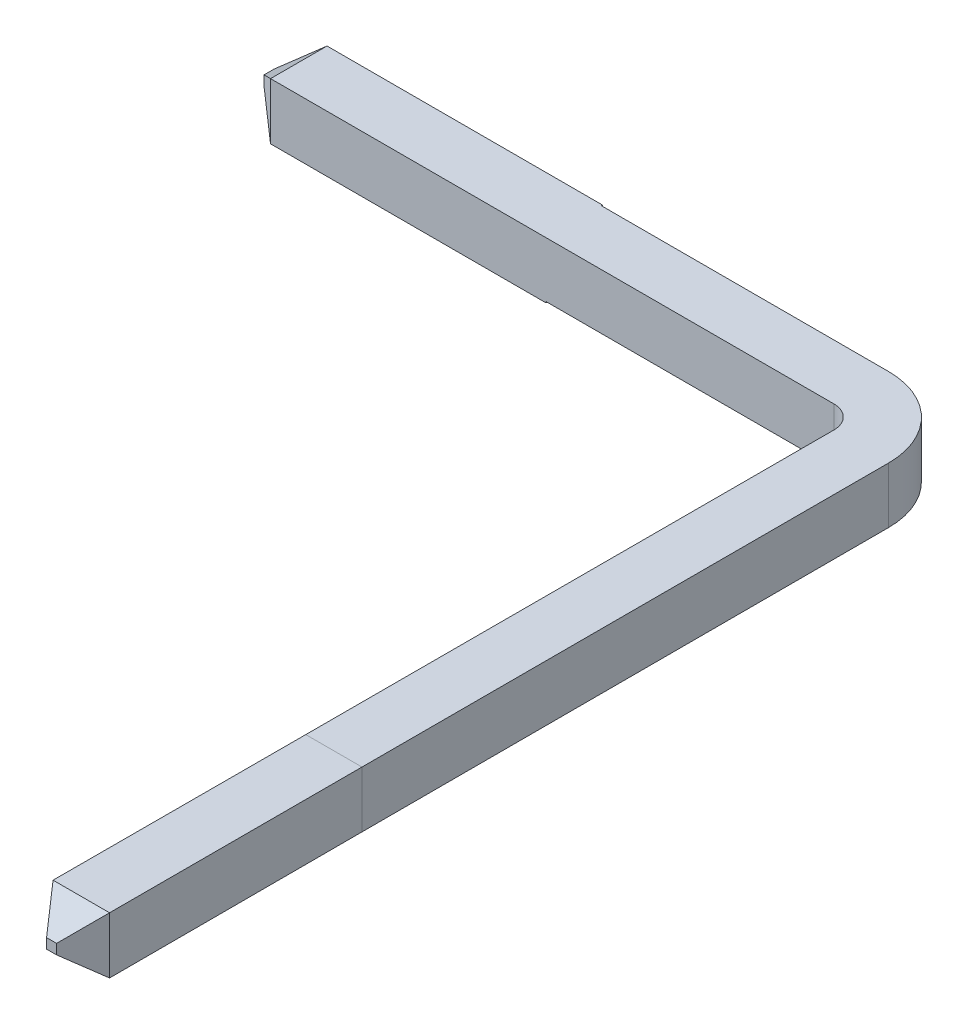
ISO-10303-21;
HEADER;
FILE_DESCRIPTION(('STEP AP214'),'2;1');
FILE_NAME('part.step','',(''),(''),'','','');
FILE_SCHEMA(('AUTOMOTIVE_DESIGN { 1 0 10303 214 1 1 1 1 }'));
ENDSEC;
DATA;
#1=APPLICATION_CONTEXT('core data for automotive mechanical design processes');
#2=APPLICATION_PROTOCOL_DEFINITION('international standard','automotive_design',2000,#1);
#3=PRODUCT_CONTEXT('',#1,'mechanical');
#4=PRODUCT('Part','Part','',(#3));
#5=PRODUCT_RELATED_PRODUCT_CATEGORY('part','',(#4));
#6=PRODUCT_DEFINITION_FORMATION('','',#4);
#7=PRODUCT_DEFINITION_CONTEXT('part definition',#1,'design');
#8=PRODUCT_DEFINITION('design','',#6,#7);
#9=PRODUCT_DEFINITION_SHAPE('','',#8);
#10=(LENGTH_UNIT() NAMED_UNIT(*) SI_UNIT(.MILLI.,.METRE.));
#11=(NAMED_UNIT(*) PLANE_ANGLE_UNIT() SI_UNIT($,.RADIAN.));
#12=(NAMED_UNIT(*) SI_UNIT($,.STERADIAN.) SOLID_ANGLE_UNIT());
#13=UNCERTAINTY_MEASURE_WITH_UNIT(LENGTH_MEASURE(1.E-05),#10,'distance_accuracy_value','');
#14=(GEOMETRIC_REPRESENTATION_CONTEXT(3) GLOBAL_UNCERTAINTY_ASSIGNED_CONTEXT((#13)) GLOBAL_UNIT_ASSIGNED_CONTEXT((#10,
#11,#12)) REPRESENTATION_CONTEXT('',''));
#15=CARTESIAN_POINT('',(0.,0.,0.));
#16=DIRECTION('',(0.,0.,1.));
#17=DIRECTION('',(1.,0.,0.));
#18=AXIS2_PLACEMENT_3D('',#15,#16,#17);
#19=CARTESIAN_POINT('',(-2.543175,-12.3888499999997,-0.916440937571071));
#20=DIRECTION('',(0.,1.,0.));
#21=DIRECTION('',(0.,0.,-1.));
#22=AXIS2_PLACEMENT_3D('',#19,#20,#21);
#23=PLANE('',#22);
#24=DIRECTION('',(0.,0.,1.));
#25=VECTOR('',#24,1.);
#26=CARTESIAN_POINT('',(-2.22885,-12.3888499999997,-0.916440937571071));
#27=LINE('',#26,#25);
#28=CARTESIAN_POINT('',(-2.22885,-12.3888499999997,-0.0274409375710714));
#29=VERTEX_POINT('',#28);
#30=CARTESIAN_POINT('',(-2.225675,-12.3856749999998,5.89710906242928));
#31=VERTEX_POINT('',#30);
#32=EDGE_CURVE('E297',#29,#31,#27,.T.);
#33=ORIENTED_EDGE('',*,*,#32,.F.);
#34=CARTESIAN_POINT('',(-3.11785,-12.3888499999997,-0.0274409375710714));
#35=DIRECTION('',(0.,1.,0.));
#36=DIRECTION('',(0.,0.,-1.));
#37=AXIS2_PLACEMENT_3D('',#34,#35,#36);
#38=CIRCLE('',#37,0.889);
#39=CARTESIAN_POINT('',(-3.11785,-12.3888499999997,-0.916440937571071));
#40=VERTEX_POINT('',#39);
#41=EDGE_CURVE('E174',#29,#40,#38,.T.);
#42=ORIENTED_EDGE('',*,*,#41,.T.);
#43=DIRECTION('',(1.,0.,0.));
#44=VECTOR('',#43,1.);
#45=CARTESIAN_POINT('',(-2.543175,-12.3888499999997,-0.916440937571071));
#46=LINE('',#45,#44);
#47=CARTESIAN_POINT('',(-6.35,-12.3888499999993,-0.916440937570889));
#48=VERTEX_POINT('',#47);
#49=EDGE_CURVE('E271',#48,#40,#46,.T.);
#50=ORIENTED_EDGE('',*,*,#49,.F.);
#51=DIRECTION('',(0.,0.,1.));
#52=VECTOR('',#51,1.);
#53=CARTESIAN_POINT('',(-6.35,-12.3888499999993,0.658359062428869));
#54=LINE('',#53,#52);
#55=CARTESIAN_POINT('',(-6.35,-12.3888499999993,-0.929140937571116));
#56=VERTEX_POINT('',#55);
#57=EDGE_CURVE('E182',#56,#48,#54,.T.);
#58=ORIENTED_EDGE('',*,*,#57,.F.);
#59=DIRECTION('',(-1.,0.,0.));
#60=VECTOR('',#59,1.);
#61=CARTESIAN_POINT('',(1.85784727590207,-12.3888499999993,-0.929140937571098));
#62=LINE('',#61,#60);
#63=CARTESIAN_POINT('',(-9.44473525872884,-12.3888499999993,-0.929140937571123));
#64=VERTEX_POINT('',#63);
#65=EDGE_CURVE('E185',#56,#64,#62,.T.);
#66=ORIENTED_EDGE('',*,*,#65,.T.);
#67=DIRECTION('',(0.,0.,1.));
#68=VECTOR('',#67,1.);
#69=CARTESIAN_POINT('',(-9.4447352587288,-12.3888499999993,-26.3418409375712));
#70=LINE('',#69,#68);
#71=CARTESIAN_POINT('',(-9.44473525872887,-12.3888499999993,-0.294140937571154));
#72=VERTEX_POINT('',#71);
#73=EDGE_CURVE('E215',#64,#72,#70,.T.);
#74=ORIENTED_EDGE('',*,*,#73,.T.);
#75=DIRECTION('',(-1.,0.,0.));
#76=VECTOR('',#75,1.);
#77=CARTESIAN_POINT('',(-6.003925,-12.3888499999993,-0.294140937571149));
#78=LINE('',#77,#76);
#79=CARTESIAN_POINT('',(-3.1115,-12.3888499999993,-0.294140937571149));
#80=VERTEX_POINT('',#79);
#81=EDGE_CURVE('E266',#80,#72,#78,.T.);
#82=ORIENTED_EDGE('',*,*,#81,.F.);
#83=CARTESIAN_POINT('',(-3.1115,-12.3888499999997,-0.0401409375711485));
#84=DIRECTION('',(0.,1.,0.));
#85=DIRECTION('',(0.,0.,-1.));
#86=AXIS2_PLACEMENT_3D('',#83,#84,#85);
#87=CIRCLE('',#86,0.254);
#88=CARTESIAN_POINT('',(-2.8575,-12.3888499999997,-0.0401409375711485));
#89=VERTEX_POINT('',#88);
#90=EDGE_CURVE('E320',#80,#89,#87,.F.);
#91=ORIENTED_EDGE('',*,*,#90,.T.);
#92=DIRECTION('',(0.,0.,1.));
#93=VECTOR('',#92,1.);
#94=CARTESIAN_POINT('',(-2.8575,-12.3888499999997,-0.916440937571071));
#95=LINE('',#94,#93);
#96=CARTESIAN_POINT('',(-2.8575,-12.3856749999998,5.89710906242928));
#97=VERTEX_POINT('',#96);
#98=EDGE_CURVE('E349',#89,#97,#95,.T.);
#99=ORIENTED_EDGE('',*,*,#98,.T.);
#100=CARTESIAN_POINT('',(-2.8575,-12.3888499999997,5.89710906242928));
#101=DIRECTION('',(1.,0.,0.));
#102=VECTOR('',#101,1.);
#103=LINE('',#100,#102);
#104=EDGE_CURVE('E284',#97,#31,#103,.T.);
#105=ORIENTED_EDGE('',*,*,#104,.T.);
#106=EDGE_LOOP('',(#33,#42,#50,#58,#66,#74,#82,#91,#99,#105));
#107=FACE_BOUND('',#106,.T.);
#108=ADVANCED_FACE('F17',(#107),#23,.T.);
#109=CARTESIAN_POINT('',(-2.543175,-12.7031749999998,-0.916440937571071));
#110=DIRECTION('',(0.,0.,-1.));
#111=DIRECTION('',(0.,-1.,0.));
#112=AXIS2_PLACEMENT_3D('',#109,#110,#111);
#113=PLANE('',#112);
#114=ORIENTED_EDGE('',*,*,#49,.T.);
#115=DIRECTION('',(0.,-1.,0.));
#116=VECTOR('',#115,1.);
#117=CARTESIAN_POINT('',(-3.11785,-12.7031749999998,-0.916440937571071));
#118=LINE('',#117,#116);
#119=CARTESIAN_POINT('',(-3.11785,-13.0111499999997,-0.916440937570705));
#120=VERTEX_POINT('',#119);
#121=EDGE_CURVE('E314',#40,#120,#118,.T.);
#122=ORIENTED_EDGE('',*,*,#121,.T.);
#123=DIRECTION('',(-1.,0.,0.));
#124=VECTOR('',#123,1.);
#125=CARTESIAN_POINT('',(-6.003925,-13.0111499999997,-0.916440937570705));
#126=LINE('',#125,#124);
#127=CARTESIAN_POINT('',(-6.35,-13.0111499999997,-0.916440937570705));
#128=VERTEX_POINT('',#127);
#129=EDGE_CURVE('E282',#120,#128,#126,.T.);
#130=ORIENTED_EDGE('',*,*,#129,.T.);
#131=DIRECTION('',(0.,1.,0.));
#132=VECTOR('',#131,1.);
#133=CARTESIAN_POINT('',(-6.35,-12.7031749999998,-0.916440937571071));
#134=LINE('',#133,#132);
#135=EDGE_CURVE('E276',#128,#48,#134,.T.);
#136=ORIENTED_EDGE('',*,*,#135,.T.);
#137=EDGE_LOOP('',(#114,#122,#130,#136));
#138=FACE_BOUND('',#137,.T.);
#139=ADVANCED_FACE('F313',(#138),#113,.T.);
#140=CARTESIAN_POINT('',(-6.003925,-12.6999999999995,-0.294140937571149));
#141=DIRECTION('',(0.,0.,1.));
#142=DIRECTION('',(0.,1.,0.));
#143=AXIS2_PLACEMENT_3D('',#140,#141,#142);
#144=PLANE('',#143);
#145=DIRECTION('',(1.,0.,0.));
#146=VECTOR('',#145,1.);
#147=CARTESIAN_POINT('',(-6.003925,-13.0111499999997,-0.294140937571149));
#148=LINE('',#147,#146);
#149=CARTESIAN_POINT('',(-6.35,-13.0111499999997,-0.294140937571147));
#150=VERTEX_POINT('',#149);
#151=CARTESIAN_POINT('',(-3.1115,-13.0111499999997,-0.294140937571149));
#152=VERTEX_POINT('',#151);
#153=EDGE_CURVE('E270',#150,#152,#148,.T.);
#154=ORIENTED_EDGE('',*,*,#153,.T.);
#155=DIRECTION('',(0.,-1.,0.));
#156=VECTOR('',#155,1.);
#157=CARTESIAN_POINT('',(-3.1115,-12.3888499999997,-0.294140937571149));
#158=LINE('',#157,#156);
#159=EDGE_CURVE('E268',#152,#80,#158,.F.);
#160=ORIENTED_EDGE('',*,*,#159,.T.);
#161=ORIENTED_EDGE('',*,*,#81,.T.);
#162=DIRECTION('',(0.,-1.,0.));
#163=VECTOR('',#162,1.);
#164=CARTESIAN_POINT('',(-9.44473525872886,-13.0238499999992,-0.294140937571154));
#165=LINE('',#164,#163);
#166=CARTESIAN_POINT('',(-9.44473525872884,-13.0238499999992,-0.294140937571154));
#167=VERTEX_POINT('',#166);
#168=EDGE_CURVE('E197',#167,#72,#165,.F.);
#169=ORIENTED_EDGE('',*,*,#168,.F.);
#170=DIRECTION('',(-1.,0.,0.));
#171=VECTOR('',#170,1.);
#172=CARTESIAN_POINT('',(1.85784727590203,-13.0238499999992,-0.29414093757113));
#173=LINE('',#172,#171);
#174=CARTESIAN_POINT('',(-6.35,-13.0238499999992,-0.294140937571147));
#175=VERTEX_POINT('',#174);
#176=EDGE_CURVE('E190',#175,#167,#173,.T.);
#177=ORIENTED_EDGE('',*,*,#176,.F.);
#178=DIRECTION('',(0.,-1.,0.));
#179=VECTOR('',#178,1.);
#180=CARTESIAN_POINT('',(-6.35,-15.2463499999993,-0.294140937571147));
#181=LINE('',#180,#179);
#182=EDGE_CURVE('E188',#150,#175,#181,.T.);
#183=ORIENTED_EDGE('',*,*,#182,.F.);
#184=EDGE_LOOP('',(#154,#160,#161,#169,#177,#183));
#185=FACE_BOUND('',#184,.T.);
#186=ADVANCED_FACE('F264',(#185),#144,.T.);
#187=CARTESIAN_POINT('',(-6.003925,-13.0111499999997,-0.916440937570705));
#188=DIRECTION('',(0.,-1.,0.));
#189=DIRECTION('',(0.,0.,1.));
#190=AXIS2_PLACEMENT_3D('',#187,#188,#189);
#191=PLANE('',#190);
#192=ORIENTED_EDGE('',*,*,#129,.F.);
#193=CARTESIAN_POINT('',(-3.11785,-13.0111499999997,-0.0274409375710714));
#194=DIRECTION('',(0.,-1.,0.));
#195=DIRECTION('',(0.,0.,1.));
#196=AXIS2_PLACEMENT_3D('',#193,#194,#195);
#197=CIRCLE('',#196,0.889);
#198=CARTESIAN_POINT('',(-2.8575,-13.0111499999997,-0.877463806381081));
#199=VERTEX_POINT('',#198);
#200=EDGE_CURVE('E319',#120,#199,#197,.T.);
#201=ORIENTED_EDGE('',*,*,#200,.T.);
#202=DIRECTION('',(0.,0.,-1.));
#203=VECTOR('',#202,1.);
#204=CARTESIAN_POINT('',(-2.8575,-13.0111499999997,-0.916440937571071));
#205=LINE('',#204,#203);
#206=CARTESIAN_POINT('',(-2.8575,-13.0111499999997,-0.0401409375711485));
#207=VERTEX_POINT('',#206);
#208=EDGE_CURVE('E329',#207,#199,#205,.T.);
#209=ORIENTED_EDGE('',*,*,#208,.F.);
#210=CARTESIAN_POINT('',(-3.1115,-13.0111499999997,-0.0401409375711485));
#211=DIRECTION('',(0.,-1.,0.));
#212=DIRECTION('',(0.,0.,1.));
#213=AXIS2_PLACEMENT_3D('',#210,#211,#212);
#214=CIRCLE('',#213,0.254);
#215=EDGE_CURVE('E324',#207,#152,#214,.F.);
#216=ORIENTED_EDGE('',*,*,#215,.T.);
#217=ORIENTED_EDGE('',*,*,#153,.F.);
#218=DIRECTION('',(0.,0.,-1.));
#219=VECTOR('',#218,1.);
#220=CARTESIAN_POINT('',(-6.35,-13.0111499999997,-0.916440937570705));
#221=LINE('',#220,#219);
#222=EDGE_CURVE('E273',#150,#128,#221,.T.);
#223=ORIENTED_EDGE('',*,*,#222,.T.);
#224=EDGE_LOOP('',(#192,#201,#209,#216,#217,#223));
#225=FACE_BOUND('',#224,.T.);
#226=ADVANCED_FACE('F360',(#225),#191,.T.);
#227=CARTESIAN_POINT('',(-2.8575,-12.7031749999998,-0.916440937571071));
#228=DIRECTION('',(-1.,0.,0.));
#229=DIRECTION('',(0.,0.,-1.));
#230=AXIS2_PLACEMENT_3D('',#227,#228,#229);
#231=PLANE('',#230);
#232=DIRECTION('',(0.,-1.,0.));
#233=VECTOR('',#232,1.);
#234=CARTESIAN_POINT('',(-2.8575,-12.7031749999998,8.73784432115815));
#235=LINE('',#234,#233);
#236=CARTESIAN_POINT('',(-2.8575,-12.3825,8.73784432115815));
#237=VERTEX_POINT('',#236);
#238=CARTESIAN_POINT('',(-2.8575,-13.0175,8.73784432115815));
#239=VERTEX_POINT('',#238);
#240=EDGE_CURVE('E26',#237,#239,#235,.T.);
#241=ORIENTED_EDGE('',*,*,#240,.F.);
#242=DIRECTION('',(0.,0.,1.));
#243=VECTOR('',#242,1.);
#244=CARTESIAN_POINT('',(-2.85749999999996,-12.3825,-2.31073821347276));
#245=LINE('',#244,#243);
#246=EDGE_CURVE('E370',#97,#237,#245,.T.);
#247=ORIENTED_EDGE('',*,*,#246,.F.);
#248=ORIENTED_EDGE('',*,*,#98,.F.);
#249=DIRECTION('',(0.,-1.,0.));
#250=VECTOR('',#249,1.);
#251=CARTESIAN_POINT('',(-2.8575,-13.0111499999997,-0.0401409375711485));
#252=LINE('',#251,#250);
#253=EDGE_CURVE('E354',#89,#207,#252,.T.);
#254=ORIENTED_EDGE('',*,*,#253,.T.);
#255=ORIENTED_EDGE('',*,*,#208,.T.);
#256=DIRECTION('',(0.,-1.,0.));
#257=VECTOR('',#256,1.);
#258=CARTESIAN_POINT('',(-2.8575,-13.0111499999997,-0.877463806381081));
#259=LINE('',#258,#257);
#260=CARTESIAN_POINT('',(-2.8575,-13.0175,-0.877463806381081));
#261=VERTEX_POINT('',#260);
#262=EDGE_CURVE('E322',#199,#261,#259,.T.);
#263=ORIENTED_EDGE('',*,*,#262,.T.);
#264=DIRECTION('',(0.,0.,1.));
#265=VECTOR('',#264,1.);
#266=CARTESIAN_POINT('',(-2.8575,-13.0175,-0.916440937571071));
#267=LINE('',#266,#265);
#268=EDGE_CURVE('E295',#261,#239,#267,.T.);
#269=ORIENTED_EDGE('',*,*,#268,.T.);
#270=EDGE_LOOP('',(#241,#247,#248,#254,#255,#263,#269));
#271=FACE_BOUND('',#270,.T.);
#272=ADVANCED_FACE('F369',(#271),#231,.T.);
#273=CARTESIAN_POINT('',(-2.543175,-13.0175,-0.916440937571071));
#274=DIRECTION('',(0.,-1.,0.));
#275=DIRECTION('',(0.,0.,1.));
#276=AXIS2_PLACEMENT_3D('',#273,#274,#275);
#277=PLANE('',#276);
#278=DIRECTION('',(1.,0.,0.));
#279=VECTOR('',#278,1.);
#280=CARTESIAN_POINT('',(-2.54317500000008,-13.0175,8.73784432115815));
#281=LINE('',#280,#279);
#282=CARTESIAN_POINT('',(-2.2225,-13.0175,8.73784432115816));
#283=VERTEX_POINT('',#282);
#284=EDGE_CURVE('E173',#239,#283,#281,.T.);
#285=ORIENTED_EDGE('',*,*,#284,.F.);
#286=ORIENTED_EDGE('',*,*,#268,.F.);
#287=CARTESIAN_POINT('',(-3.11785,-13.0175,-0.0274409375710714));
#288=DIRECTION('',(0.,-1.,0.));
#289=DIRECTION('',(0.,0.,1.));
#290=AXIS2_PLACEMENT_3D('',#287,#288,#289);
#291=CIRCLE('',#290,0.889);
#292=CARTESIAN_POINT('',(-2.22885,-13.0175,-0.0274409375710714));
#293=VERTEX_POINT('',#292);
#294=EDGE_CURVE('E302',#261,#293,#291,.T.);
#295=ORIENTED_EDGE('',*,*,#294,.T.);
#296=DIRECTION('',(0.,0.,1.));
#297=VECTOR('',#296,1.);
#298=CARTESIAN_POINT('',(-2.22885,-13.0175,-0.916440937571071));
#299=LINE('',#298,#297);
#300=CARTESIAN_POINT('',(-2.225675,-13.0175,5.89710906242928));
#301=VERTEX_POINT('',#300);
#302=EDGE_CURVE('E301',#293,#301,#299,.T.);
#303=ORIENTED_EDGE('',*,*,#302,.T.);
#304=DIRECTION('',(0.,0.,1.));
#305=VECTOR('',#304,1.);
#306=CARTESIAN_POINT('',(-2.2225,-13.0175,-2.31073821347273));
#307=LINE('',#306,#305);
#308=EDGE_CURVE('E352',#301,#283,#307,.T.);
#309=ORIENTED_EDGE('',*,*,#308,.T.);
#310=EDGE_LOOP('',(#285,#286,#295,#303,#309));
#311=FACE_BOUND('',#310,.T.);
#312=ADVANCED_FACE('F396',(#311),#277,.T.);
#313=CARTESIAN_POINT('',(-2.22885,-12.7031749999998,-0.916440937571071));
#314=DIRECTION('',(1.,0.,0.));
#315=DIRECTION('',(0.,0.,1.));
#316=AXIS2_PLACEMENT_3D('',#313,#314,#315);
#317=PLANE('',#316);
#318=ORIENTED_EDGE('',*,*,#302,.F.);
#319=DIRECTION('',(0.,-1.,0.));
#320=VECTOR('',#319,1.);
#321=CARTESIAN_POINT('',(-2.22885,-12.7031749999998,-0.0274409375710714));
#322=LINE('',#321,#320);
#323=EDGE_CURVE('E304',#293,#29,#322,.F.);
#324=ORIENTED_EDGE('',*,*,#323,.T.);
#325=ORIENTED_EDGE('',*,*,#32,.T.);
#326=CARTESIAN_POINT('',(-2.22885,-12.3888499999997,5.89710906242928));
#327=DIRECTION('',(0.,-1.,0.));
#328=VECTOR('',#327,1.);
#329=LINE('',#326,#328);
#330=EDGE_CURVE('E300',#31,#301,#329,.T.);
#331=ORIENTED_EDGE('',*,*,#330,.T.);
#332=EDGE_LOOP('',(#318,#324,#325,#331));
#333=FACE_BOUND('',#332,.T.);
#334=ADVANCED_FACE('F391',(#333),#317,.T.);
#335=CARTESIAN_POINT('',(-2.85749999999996,-12.3825,-2.31073821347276));
#336=DIRECTION('',(0.,1.,0.));
#337=DIRECTION('',(0.,0.,1.));
#338=AXIS2_PLACEMENT_3D('',#335,#336,#337);
#339=PLANE('',#338);
#340=DIRECTION('',(-1.,0.,0.));
#341=VECTOR('',#340,1.);
#342=CARTESIAN_POINT('',(-2.85750000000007,-12.3825,8.73784432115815));
#343=LINE('',#342,#341);
#344=CARTESIAN_POINT('',(-2.2225,-12.3825,8.73784432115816));
#345=VERTEX_POINT('',#344);
#346=EDGE_CURVE('E32',#345,#237,#343,.T.);
#347=ORIENTED_EDGE('',*,*,#346,.F.);
#348=DIRECTION('',(0.,0.,1.));
#349=VECTOR('',#348,1.);
#350=CARTESIAN_POINT('',(-2.2225,-12.3825,-2.31073821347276));
#351=LINE('',#350,#349);
#352=EDGE_CURVE('E203',#31,#345,#351,.T.);
#353=ORIENTED_EDGE('',*,*,#352,.F.);
#354=ORIENTED_EDGE('',*,*,#104,.F.);
#355=ORIENTED_EDGE('',*,*,#246,.T.);
#356=EDGE_LOOP('',(#347,#353,#354,#355));
#357=FACE_BOUND('',#356,.T.);
#358=ADVANCED_FACE('F380',(#357),#339,.T.);
#359=CARTESIAN_POINT('',(-2.2225,-13.0175,-2.31073821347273));
#360=DIRECTION('',(1.,0.,0.));
#361=DIRECTION('',(0.,1.,0.));
#362=AXIS2_PLACEMENT_3D('',#359,#360,#361);
#363=PLANE('',#362);
#364=DIRECTION('',(0.,1.,0.));
#365=VECTOR('',#364,1.);
#366=CARTESIAN_POINT('',(-2.2225,-13.0175,8.73784432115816));
#367=LINE('',#366,#365);
#368=EDGE_CURVE('E11',#283,#345,#367,.T.);
#369=ORIENTED_EDGE('',*,*,#368,.F.);
#370=ORIENTED_EDGE('',*,*,#308,.F.);
#371=ORIENTED_EDGE('',*,*,#330,.F.);
#372=ORIENTED_EDGE('',*,*,#352,.T.);
#373=EDGE_LOOP('',(#369,#370,#371,#372));
#374=FACE_BOUND('',#373,.T.);
#375=ADVANCED_FACE('F390',(#374),#363,.T.);
#376=CARTESIAN_POINT('',(-9.779,-16.8396794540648,-3.15164093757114));
#377=DIRECTION('',(1.,0.,0.));
#378=DIRECTION('',(0.,-1.,0.));
#379=AXIS2_PLACEMENT_3D('',#376,#377,#378);
#380=PLANE('',#379);
#381=DIRECTION('',(0.,0.,-1.));
#382=VECTOR('',#381,1.);
#383=CARTESIAN_POINT('',(-9.779,-12.6500062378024,-3.15164093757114));
#384=LINE('',#383,#382);
#385=CARTESIAN_POINT('',(-9.779,-12.6500062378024,-0.555297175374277));
#386=VERTEX_POINT('',#385);
#387=CARTESIAN_POINT('',(-9.779,-12.6500062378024,-0.667984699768));
#388=VERTEX_POINT('',#387);
#389=EDGE_CURVE('E186',#386,#388,#384,.T.);
#390=ORIENTED_EDGE('',*,*,#389,.T.);
#391=DIRECTION('',(0.,-1.,0.));
#392=VECTOR('',#391,1.);
#393=CARTESIAN_POINT('',(-9.779,-16.8396794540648,-0.667984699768));
#394=LINE('',#393,#392);
#395=CARTESIAN_POINT('',(-9.779,-12.7626937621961,-0.667984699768));
#396=VERTEX_POINT('',#395);
#397=EDGE_CURVE('E204',#388,#396,#394,.T.);
#398=ORIENTED_EDGE('',*,*,#397,.T.);
#399=DIRECTION('',(0.,0.,-1.));
#400=VECTOR('',#399,1.);
#401=CARTESIAN_POINT('',(-9.779,-12.7626937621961,-3.15164093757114));
#402=LINE('',#401,#400);
#403=CARTESIAN_POINT('',(-9.779,-12.7626937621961,-0.555297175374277));
#404=VERTEX_POINT('',#403);
#405=EDGE_CURVE('E219',#404,#396,#402,.T.);
#406=ORIENTED_EDGE('',*,*,#405,.F.);
#407=DIRECTION('',(0.,-1.,0.));
#408=VECTOR('',#407,1.);
#409=CARTESIAN_POINT('',(-9.779,-16.8396794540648,-0.555297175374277));
#410=LINE('',#409,#408);
#411=EDGE_CURVE('E167',#386,#404,#410,.T.);
#412=ORIENTED_EDGE('',*,*,#411,.F.);
#413=EDGE_LOOP('',(#390,#398,#406,#412));
#414=FACE_BOUND('',#413,.T.);
#415=ADVANCED_FACE('F469',(#414),#380,.F.);
#416=CARTESIAN_POINT('',(-9.55856592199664,-15.5765499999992,-0.383075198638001));
#417=DIRECTION('',(0.615661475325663,0.,-0.788010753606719));
#418=DIRECTION('',(-0.788010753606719,0.,-0.615661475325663));
#419=AXIS2_PLACEMENT_3D('',#416,#417,#418);
#420=PLANE('',#419);
#421=ORIENTED_EDGE('',*,*,#168,.T.);
#422=DIRECTION('',(0.671032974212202,0.524268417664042,0.524268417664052));
#423=VECTOR('',#422,1.);
#424=CARTESIAN_POINT('',(-18.3707600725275,-19.3626248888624,-7.26791582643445));
#425=LINE('',#424,#423);
#426=EDGE_CURVE('E208',#386,#72,#425,.T.);
#427=ORIENTED_EDGE('',*,*,#426,.F.);
#428=ORIENTED_EDGE('',*,*,#411,.T.);
#429=DIRECTION('',(0.671032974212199,-0.524268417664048,0.52426841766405));
#430=VECTOR('',#429,1.);
#431=CARTESIAN_POINT('',(-10.3285801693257,-12.3333146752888,-0.984676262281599));
#432=LINE('',#431,#430);
#433=EDGE_CURVE('E211',#404,#167,#432,.T.);
#434=ORIENTED_EDGE('',*,*,#433,.T.);
#435=EDGE_LOOP('',(#421,#427,#428,#434));
#436=FACE_BOUND('',#435,.T.);
#437=ADVANCED_FACE('F261',(#436),#420,.F.);
#438=CARTESIAN_POINT('',(-9.18347271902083,-15.5765499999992,-1.13326160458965));
#439=DIRECTION('',(-0.615661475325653,0.,-0.788010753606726));
#440=DIRECTION('',(-0.788010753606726,0.,0.615661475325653));
#441=AXIS2_PLACEMENT_3D('',#438,#439,#440);
#442=PLANE('',#441);
#443=DIRECTION('',(0.,1.,0.));
#444=VECTOR('',#443,1.);
#445=CARTESIAN_POINT('',(-9.44473525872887,-12.3888499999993,-0.929140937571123));
#446=LINE('',#445,#444);
#447=CARTESIAN_POINT('',(-9.44473525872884,-13.0238499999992,-0.929140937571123));
#448=VERTEX_POINT('',#447);
#449=EDGE_CURVE('E179',#64,#448,#446,.F.);
#450=ORIENTED_EDGE('',*,*,#449,.T.);
#451=DIRECTION('',(0.671032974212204,-0.52426841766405,-0.524268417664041));
#452=VECTOR('',#451,1.);
#453=CARTESIAN_POINT('',(-8.30909943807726,-13.9111059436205,-1.81639688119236));
#454=LINE('',#453,#452);
#455=EDGE_CURVE('E207',#396,#448,#454,.T.);
#456=ORIENTED_EDGE('',*,*,#455,.F.);
#457=ORIENTED_EDGE('',*,*,#397,.F.);
#458=DIRECTION('',(0.671032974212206,0.524268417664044,-0.524268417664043));
#459=VECTOR('',#458,1.);
#460=CARTESIAN_POINT('',(-0.266919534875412,-5.2183544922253,-8.09963644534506));
#461=LINE('',#460,#459);
#462=EDGE_CURVE('E212',#388,#64,#461,.T.);
#463=ORIENTED_EDGE('',*,*,#462,.T.);
#464=EDGE_LOOP('',(#450,#456,#457,#463));
#465=FACE_BOUND('',#464,.T.);
#466=ADVANCED_FACE('F246',(#465),#442,.T.);
#467=CARTESIAN_POINT('',(-9.11708606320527,-13.2798376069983,-3.48184093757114));
#468=DIRECTION('',(0.615661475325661,0.78801075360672,0.));
#469=DIRECTION('',(0.78801075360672,-0.615661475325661,0.));
#470=AXIS2_PLACEMENT_3D('',#467,#468,#469);
#471=PLANE('',#470);
#472=ORIENTED_EDGE('',*,*,#433,.F.);
#473=ORIENTED_EDGE('',*,*,#405,.T.);
#474=ORIENTED_EDGE('',*,*,#455,.T.);
#475=DIRECTION('',(0.,0.,-1.));
#476=VECTOR('',#475,1.);
#477=CARTESIAN_POINT('',(-9.44473525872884,-13.0238499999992,-3.48184093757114));
#478=LINE('',#477,#476);
#479=EDGE_CURVE('E216',#167,#448,#478,.T.);
#480=ORIENTED_EDGE('',*,*,#479,.F.);
#481=EDGE_LOOP('',(#472,#473,#474,#480));
#482=FACE_BOUND('',#481,.T.);
#483=ADVANCED_FACE('F241',(#482),#471,.F.);
#484=CARTESIAN_POINT('',(-9.11708606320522,-12.1328623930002,-26.3418409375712));
#485=DIRECTION('',(-0.615661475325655,0.788010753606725,0.));
#486=DIRECTION('',(0.788010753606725,0.615661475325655,0.));
#487=AXIS2_PLACEMENT_3D('',#484,#485,#486);
#488=PLANE('',#487);
#489=ORIENTED_EDGE('',*,*,#462,.F.);
#490=ORIENTED_EDGE('',*,*,#389,.F.);
#491=ORIENTED_EDGE('',*,*,#426,.T.);
#492=ORIENTED_EDGE('',*,*,#73,.F.);
#493=EDGE_LOOP('',(#489,#490,#491,#492));
#494=FACE_BOUND('',#493,.T.);
#495=ADVANCED_FACE('F256',(#494),#488,.T.);
#496=CARTESIAN_POINT('',(1.85784727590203,-13.0238499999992,-0.29414093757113));
#497=DIRECTION('',(0.,1.,0.));
#498=DIRECTION('',(-1.,0.,0.));
#499=AXIS2_PLACEMENT_3D('',#496,#497,#498);
#500=PLANE('',#499);
#501=DIRECTION('',(0.,0.,1.));
#502=VECTOR('',#501,1.);
#503=CARTESIAN_POINT('',(-6.35,-13.0238499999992,0.658359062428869));
#504=LINE('',#503,#502);
#505=CARTESIAN_POINT('',(-6.35,-13.0238499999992,-0.929140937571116));
#506=VERTEX_POINT('',#505);
#507=EDGE_CURVE('E198',#506,#175,#504,.T.);
#508=ORIENTED_EDGE('',*,*,#507,.T.);
#509=ORIENTED_EDGE('',*,*,#176,.T.);
#510=ORIENTED_EDGE('',*,*,#479,.T.);
#511=DIRECTION('',(1.,0.,0.));
#512=VECTOR('',#511,1.);
#513=CARTESIAN_POINT('',(1.85784727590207,-13.0238499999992,-0.929140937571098));
#514=LINE('',#513,#512);
#515=EDGE_CURVE('E191',#448,#506,#514,.T.);
#516=ORIENTED_EDGE('',*,*,#515,.T.);
#517=EDGE_LOOP('',(#508,#509,#510,#516));
#518=FACE_BOUND('',#517,.T.);
#519=ADVANCED_FACE('F236',(#518),#500,.F.);
#520=CARTESIAN_POINT('',(1.85784727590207,-12.3888499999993,-0.929140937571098));
#521=DIRECTION('',(0.,0.,1.));
#522=DIRECTION('',(0.,1.,0.));
#523=AXIS2_PLACEMENT_3D('',#520,#521,#522);
#524=PLANE('',#523);
#525=DIRECTION('',(0.,-1.,0.));
#526=VECTOR('',#525,1.);
#527=CARTESIAN_POINT('',(-6.35,-15.2463499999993,-0.929140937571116));
#528=LINE('',#527,#526);
#529=EDGE_CURVE('E201',#56,#506,#528,.T.);
#530=ORIENTED_EDGE('',*,*,#529,.T.);
#531=ORIENTED_EDGE('',*,*,#515,.F.);
#532=ORIENTED_EDGE('',*,*,#449,.F.);
#533=ORIENTED_EDGE('',*,*,#65,.F.);
#534=EDGE_LOOP('',(#530,#531,#532,#533));
#535=FACE_BOUND('',#534,.T.);
#536=ADVANCED_FACE('F519',(#535),#524,.F.);
#537=CARTESIAN_POINT('',(-6.35,-20.6438499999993,-0.929140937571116));
#538=DIRECTION('',(-1.,0.,0.));
#539=DIRECTION('',(0.,0.,1.));
#540=AXIS2_PLACEMENT_3D('',#537,#538,#539);
#541=PLANE('',#540);
#542=ORIENTED_EDGE('',*,*,#135,.F.);
#543=ORIENTED_EDGE('',*,*,#222,.F.);
#544=ORIENTED_EDGE('',*,*,#182,.T.);
#545=ORIENTED_EDGE('',*,*,#507,.F.);
#546=ORIENTED_EDGE('',*,*,#529,.F.);
#547=ORIENTED_EDGE('',*,*,#57,.T.);
#548=EDGE_LOOP('',(#542,#543,#544,#545,#546,#547));
#549=FACE_BOUND('',#548,.T.);
#550=ADVANCED_FACE('F528',(#549),#541,.F.);
#551=CARTESIAN_POINT('',(-3.1115,-12.7031749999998,-0.0401409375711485));
#552=DIRECTION('',(0.,1.,0.));
#553=DIRECTION('',(0.,0.,-1.));
#554=AXIS2_PLACEMENT_3D('',#551,#552,#553);
#555=CYLINDRICAL_SURFACE('',#554,0.254);
#556=ORIENTED_EDGE('',*,*,#90,.F.);
#557=ORIENTED_EDGE('',*,*,#159,.F.);
#558=ORIENTED_EDGE('',*,*,#215,.F.);
#559=ORIENTED_EDGE('',*,*,#253,.F.);
#560=EDGE_LOOP('',(#556,#557,#558,#559));
#561=FACE_BOUND('',#560,.T.);
#562=ADVANCED_FACE('F365',(#561),#555,.F.);
#563=CARTESIAN_POINT('',(-3.11785,-12.7031749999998,-0.0274409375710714));
#564=DIRECTION('',(0.,-1.,0.));
#565=DIRECTION('',(0.,0.,1.));
#566=AXIS2_PLACEMENT_3D('',#563,#564,#565);
#567=CYLINDRICAL_SURFACE('',#566,0.889);
#568=ORIENTED_EDGE('',*,*,#41,.F.);
#569=ORIENTED_EDGE('',*,*,#323,.F.);
#570=ORIENTED_EDGE('',*,*,#294,.F.);
#571=ORIENTED_EDGE('',*,*,#262,.F.);
#572=ORIENTED_EDGE('',*,*,#200,.F.);
#573=ORIENTED_EDGE('',*,*,#121,.F.);
#574=EDGE_LOOP('',(#568,#569,#570,#571,#572,#573));
#575=FACE_BOUND('',#574,.T.);
#576=ADVANCED_FACE('F317',(#575),#567,.T.);
#577=CARTESIAN_POINT('',(-5.08,-16.8333294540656,9.07210906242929));
#578=DIRECTION('',(0.,0.,-1.));
#579=DIRECTION('',(0.,-1.,0.));
#580=AXIS2_PLACEMENT_3D('',#577,#578,#579);
#581=PLANE('',#580);
#582=DIRECTION('',(-1.,0.,0.));
#583=VECTOR('',#582,1.);
#584=CARTESIAN_POINT('',(-5.08,-12.6436562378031,9.07210906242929));
#585=LINE('',#584,#583);
#586=CARTESIAN_POINT('',(-2.48365623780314,-12.6436562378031,9.07210906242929));
#587=VERTEX_POINT('',#586);
#588=CARTESIAN_POINT('',(-2.59634376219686,-12.6436562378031,9.07210906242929));
#589=VERTEX_POINT('',#588);
#590=EDGE_CURVE('E161',#587,#589,#585,.T.);
#591=ORIENTED_EDGE('',*,*,#590,.T.);
#592=DIRECTION('',(0.,-1.,0.));
#593=VECTOR('',#592,1.);
#594=CARTESIAN_POINT('',(-2.59634376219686,-16.8333294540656,9.07210906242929));
#595=LINE('',#594,#593);
#596=CARTESIAN_POINT('',(-2.59634376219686,-12.7563437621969,9.07210906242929));
#597=VERTEX_POINT('',#596);
#598=EDGE_CURVE('E142',#589,#597,#595,.T.);
#599=ORIENTED_EDGE('',*,*,#598,.T.);
#600=DIRECTION('',(-1.,0.,0.));
#601=VECTOR('',#600,1.);
#602=CARTESIAN_POINT('',(-5.08,-12.7563437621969,9.07210906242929));
#603=LINE('',#602,#601);
#604=CARTESIAN_POINT('',(-2.48365623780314,-12.7563437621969,9.07210906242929));
#605=VERTEX_POINT('',#604);
#606=EDGE_CURVE('E148',#605,#597,#603,.T.);
#607=ORIENTED_EDGE('',*,*,#606,.F.);
#608=DIRECTION('',(0.,-1.,0.));
#609=VECTOR('',#608,1.);
#610=CARTESIAN_POINT('',(-2.48365623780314,-16.8333294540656,9.07210906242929));
#611=LINE('',#610,#609);
#612=EDGE_CURVE('E162',#587,#605,#611,.T.);
#613=ORIENTED_EDGE('',*,*,#612,.F.);
#614=EDGE_LOOP('',(#591,#599,#607,#613));
#615=FACE_BOUND('',#614,.T.);
#616=ADVANCED_FACE('F159',(#615),#581,.F.);
#617=CARTESIAN_POINT('',(-2.31143426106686,-15.5702,8.85167498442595));
#618=DIRECTION('',(-0.788010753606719,0.,-0.615661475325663));
#619=DIRECTION('',(-0.615661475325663,0.,0.788010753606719));
#620=AXIS2_PLACEMENT_3D('',#617,#618,#619);
#621=PLANE('',#620);
#622=ORIENTED_EDGE('',*,*,#368,.T.);
#623=DIRECTION('',(0.524268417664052,0.524268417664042,-0.671032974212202));
#624=VECTOR('',#623,1.);
#625=CARTESIAN_POINT('',(-9.19627488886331,-19.3562748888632,17.6638691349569));
#626=LINE('',#625,#624);
#627=EDGE_CURVE('E157',#587,#345,#626,.T.);
#628=ORIENTED_EDGE('',*,*,#627,.F.);
#629=ORIENTED_EDGE('',*,*,#612,.T.);
#630=DIRECTION('',(0.52426841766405,-0.524268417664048,-0.671032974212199));
#631=VECTOR('',#630,1.);
#632=CARTESIAN_POINT('',(-2.91303532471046,-12.3269646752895,9.62168923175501));
#633=LINE('',#632,#631);
#634=EDGE_CURVE('E153',#605,#283,#633,.T.);
#635=ORIENTED_EDGE('',*,*,#634,.T.);
#636=EDGE_LOOP('',(#622,#628,#629,#635));
#637=FACE_BOUND('',#636,.T.);
#638=ADVANCED_FACE('F561',(#637),#621,.F.);
#639=CARTESIAN_POINT('',(-28.2702,-12.1265123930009,8.41019512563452));
#640=DIRECTION('',(0.,0.788010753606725,0.615661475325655));
#641=DIRECTION('',(0.,0.615661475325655,-0.788010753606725));
#642=AXIS2_PLACEMENT_3D('',#639,#640,#641);
#643=PLANE('',#642);
#644=DIRECTION('',(-0.524268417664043,0.524268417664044,-0.671032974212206));
#645=VECTOR('',#644,1.);
#646=CARTESIAN_POINT('',(-10.0279955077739,-5.21200449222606,-0.439971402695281));
#647=LINE('',#646,#645);
#648=EDGE_CURVE('E147',#589,#237,#647,.T.);
#649=ORIENTED_EDGE('',*,*,#648,.F.);
#650=ORIENTED_EDGE('',*,*,#590,.F.);
#651=ORIENTED_EDGE('',*,*,#627,.T.);
#652=ORIENTED_EDGE('',*,*,#346,.T.);
#653=EDGE_LOOP('',(#649,#650,#651,#652));
#654=FACE_BOUND('',#653,.T.);
#655=ADVANCED_FACE('F570',(#654),#643,.T.);
#656=CARTESIAN_POINT('',(-5.4102,-13.273487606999,8.41019512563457));
#657=DIRECTION('',(0.,0.78801075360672,-0.615661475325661));
#658=DIRECTION('',(0.,-0.615661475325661,-0.78801075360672));
#659=AXIS2_PLACEMENT_3D('',#656,#657,#658);
#660=PLANE('',#659);
#661=ORIENTED_EDGE('',*,*,#634,.F.);
#662=ORIENTED_EDGE('',*,*,#606,.T.);
#663=DIRECTION('',(-0.524268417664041,-0.52426841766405,-0.671032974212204));
#664=VECTOR('',#663,1.);
#665=CARTESIAN_POINT('',(-3.74475594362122,-13.9047559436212,7.60220850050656));
#666=LINE('',#665,#664);
#667=EDGE_CURVE('E137',#597,#239,#666,.T.);
#668=ORIENTED_EDGE('',*,*,#667,.T.);
#669=ORIENTED_EDGE('',*,*,#284,.T.);
#670=EDGE_LOOP('',(#661,#662,#668,#669));
#671=FACE_BOUND('',#670,.T.);
#672=ADVANCED_FACE('F151',(#671),#660,.F.);
#673=CARTESIAN_POINT('',(-3.06162066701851,-15.5702,8.47658178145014));
#674=DIRECTION('',(-0.788010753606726,0.,0.615661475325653));
#675=DIRECTION('',(0.615661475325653,0.,0.788010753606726));
#676=AXIS2_PLACEMENT_3D('',#673,#674,#675);
#677=PLANE('',#676);
#678=ORIENTED_EDGE('',*,*,#240,.T.);
#679=ORIENTED_EDGE('',*,*,#667,.F.);
#680=ORIENTED_EDGE('',*,*,#598,.F.);
#681=ORIENTED_EDGE('',*,*,#648,.T.);
#682=EDGE_LOOP('',(#678,#679,#680,#681));
#683=FACE_BOUND('',#682,.T.);
#684=ADVANCED_FACE('F139',(#683),#677,.T.);
#685=CLOSED_SHELL('',(#108,#139,#186,#226,#272,#312,#334,#358,#375,#415,#437,#466,#483,#495,
#519,#536,#550,#562,#576,#616,#638,#655,#672,#684));
#686=MANIFOLD_SOLID_BREP('B1',#685);
#687=ADVANCED_BREP_SHAPE_REPRESENTATION('',(#18,#686),#14);
#688=SHAPE_DEFINITION_REPRESENTATION(#9,#687);
ENDSEC;
END-ISO-10303-21;
